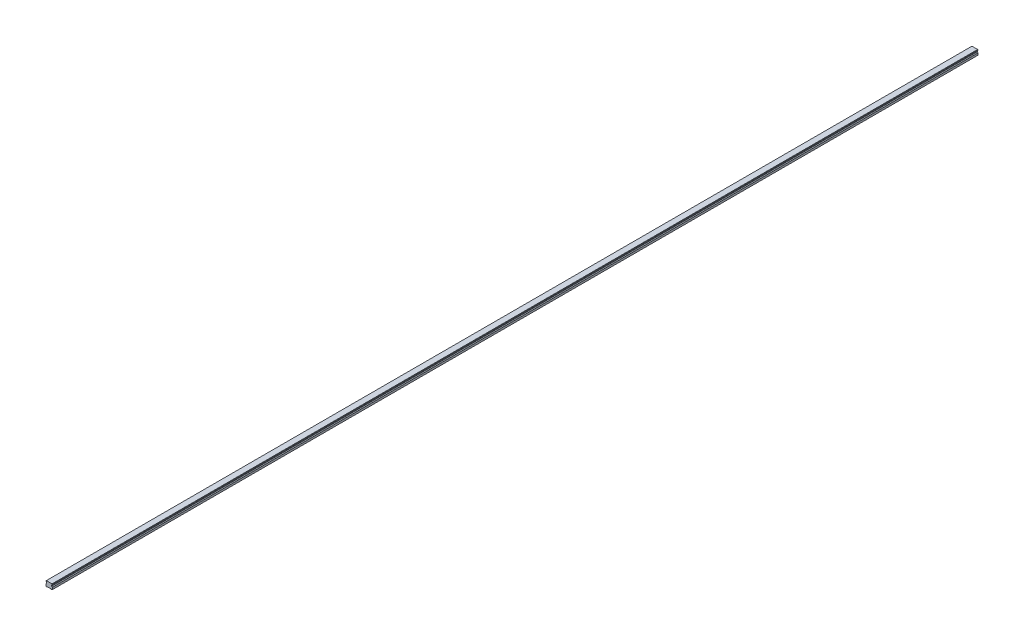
from build123d import *

# Parameters (mm, degrees)
SKETCH1_W           = 20
SKETCH1_H           = 16.3
BOSS_EXTRUDE1_DEPTH = 1460
CUT_EXTRUDE1_DEPTH  = 2921.062617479
CHAMFER1_SIZE       = 1
FILLET1_R           = 1
CUT_EXTRUDE2_DEPTH  = 2921.062617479
SKETCH5_R           = 3
SKETCH5_R_2         = 2.5
CUT_EXTRUDE5_DEPTH  = 10
SKETCH5_2_R         = 2.5
CUT_EXTRUDE6_DEPTH  = 13
LPATTERN2_COUNT     = 49
LPATTERN2_PITCH     = 60


with BuildPart() as part:
    # Sketch1 → Boss-Extrude1 (new, symmetric)
    with BuildSketch(Plane.XY):
        with Locations((0, 8.15)):
            Rectangle(SKETCH1_W, SKETCH1_H)
    extrude(amount=BOSS_EXTRUDE1_DEPTH, both=True)

    # Sketch2 → Cut-Extrude1 (cut, through all)
    with BuildSketch(Plane.XY.offset(1460)):
        Polygon((-10, 14.3), (-10, 7.3), (-7.666666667, 9.633333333), (-7.666666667, 11.966666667), align=None)
        Polygon((7.666666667, 11.966666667), (10, 14.3), (10, 7.3), (7.666666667, 9.633333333), align=None)
    extrude(amount=-CUT_EXTRUDE1_DEPTH, mode=Mode.SUBTRACT)

    # Chamfer1
    chamfer1_edges = [part.edges().sort_by_distance(p)[0] for p in [
        (-10, 16.3, 0),
        (10, 16.3, 0),
        (10, 0, 0),
        (-10, 0, 0),
    ]]
    chamfer(chamfer1_edges, length=CHAMFER1_SIZE)

    # Fillet1
    fillet1_edges = [part.edges().sort_by_distance(p)[0] for p in [
        (-7.666666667, 11.966666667, 0),
        (-7.666666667, 9.633333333, 0),
        (7.666666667, 9.633333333, 0),
        (7.666666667, 11.966666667, 0),
    ]]
    fillet(fillet1_edges, radius=FILLET1_R)

    # Sketch3 → Cut-Extrude2 (cut, through all)
    with BuildSketch(Plane.XY.offset(1460)):
        Polygon((-6, 0), (-5, 1), (5, 1), (6, 0), align=None)
    extrude(amount=-CUT_EXTRUDE2_DEPTH, mode=Mode.SUBTRACT)

    # Sketch5 → Cut-Extrude5 (cut)
    with BuildSketch(Plane.XZ.offset(-1)):
        with Locations(Location((0, 1440, 0), (0, 0, 270))):
            Circle(SKETCH5_R)
        with Locations(Location((0, 1440, 0), (0, 0, 270))):
            Circle(SKETCH5_R_2, mode=Mode.SUBTRACT)
    cut_extrude5 = extrude(amount=-CUT_EXTRUDE5_DEPTH, mode=Mode.SUBTRACT)

    # Sketch5_2 → Cut-Extrude6 (cut)
    with BuildSketch(Plane.XZ.offset(-1)):
        with Locations(Location((0, 1440, 0), (0, 0, 270))):
            Circle(SKETCH5_2_R)
    cut_extrude6 = extrude(amount=-CUT_EXTRUDE6_DEPTH, mode=Mode.SUBTRACT)

    # Cut-Extrude7 cone 1 section (on through the dimple's axis) → Cut-Extrude7 (revolve, cut)
    with BuildSketch(Plane(origin=(0, 14, 1440), x_dir=(0, 0, -1), z_dir=(1, 0, 0))):
        Polygon((0, 0), (2.5, 0), (0, 1.443375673), align=None)
    cut_extrude7 = revolve(axis=Axis((0, 14, 1440), (0, 1, 0)), mode=Mode.SUBTRACT)

    # LPattern2: Cut-Extrude5, Cut-Extrude6, Cut-Extrude7 ×49
    with Locations(*[(0, 0, -i * LPATTERN2_PITCH) for i in range(1, LPATTERN2_COUNT)]):
        add(cut_extrude5, mode=Mode.SUBTRACT)
        add(cut_extrude6, mode=Mode.SUBTRACT)
        add(cut_extrude7, mode=Mode.SUBTRACT)


solid = part.part
